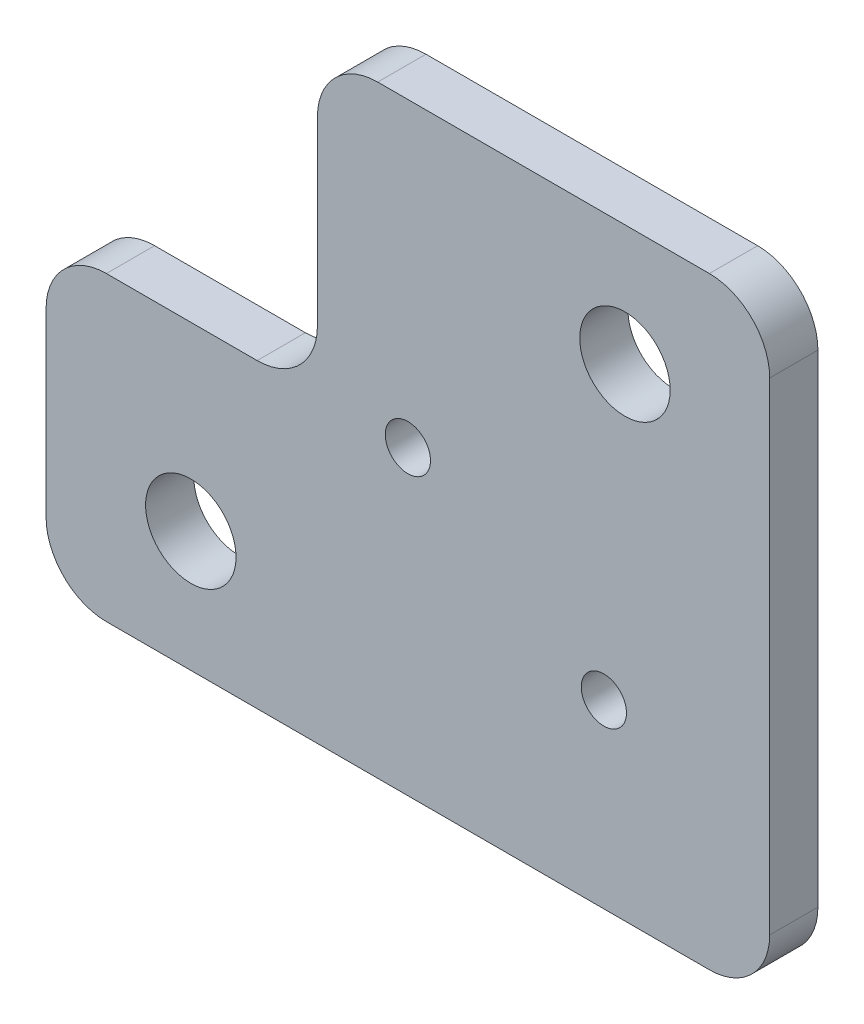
ISO-10303-21;
HEADER;
FILE_DESCRIPTION(('STEP AP214'),'2;1');
FILE_NAME('part.step','',(''),(''),'','','');
FILE_SCHEMA(('AUTOMOTIVE_DESIGN { 1 0 10303 214 1 1 1 1 }'));
ENDSEC;
DATA;
#1=APPLICATION_CONTEXT('core data for automotive mechanical design processes');
#2=APPLICATION_PROTOCOL_DEFINITION('international standard','automotive_design',2000,#1);
#3=PRODUCT_CONTEXT('',#1,'mechanical');
#4=PRODUCT('Part','Part','',(#3));
#5=PRODUCT_RELATED_PRODUCT_CATEGORY('part','',(#4));
#6=PRODUCT_DEFINITION_FORMATION('','',#4);
#7=PRODUCT_DEFINITION_CONTEXT('part definition',#1,'design');
#8=PRODUCT_DEFINITION('design','',#6,#7);
#9=PRODUCT_DEFINITION_SHAPE('','',#8);
#10=(LENGTH_UNIT() NAMED_UNIT(*) SI_UNIT(.MILLI.,.METRE.));
#11=(NAMED_UNIT(*) PLANE_ANGLE_UNIT() SI_UNIT($,.RADIAN.));
#12=(NAMED_UNIT(*) SI_UNIT($,.STERADIAN.) SOLID_ANGLE_UNIT());
#13=UNCERTAINTY_MEASURE_WITH_UNIT(LENGTH_MEASURE(1.E-05),#10,'distance_accuracy_value','');
#14=(GEOMETRIC_REPRESENTATION_CONTEXT(3) GLOBAL_UNCERTAINTY_ASSIGNED_CONTEXT((#13)) GLOBAL_UNIT_ASSIGNED_CONTEXT((#10,
#11,#12)) REPRESENTATION_CONTEXT('',''));
#15=CARTESIAN_POINT('',(0.,0.,0.));
#16=DIRECTION('',(0.,0.,1.));
#17=DIRECTION('',(1.,0.,0.));
#18=AXIS2_PLACEMENT_3D('',#15,#16,#17);
#19=CARTESIAN_POINT('',(6.,-5.,0.8));
#20=DIRECTION('',(-1.,0.,0.));
#21=DIRECTION('',(0.,0.,1.));
#22=AXIS2_PLACEMENT_3D('',#19,#20,#21);
#23=PLANE('',#22);
#24=DIRECTION('',(0.,1.,0.));
#25=VECTOR('',#24,1.);
#26=CARTESIAN_POINT('',(6.,-5.,0.8));
#27=LINE('',#26,#25);
#28=CARTESIAN_POINT('',(6.,-4.,0.8));
#29=VERTEX_POINT('',#28);
#30=CARTESIAN_POINT('',(6.,4.,0.8));
#31=VERTEX_POINT('',#30);
#32=EDGE_CURVE('E150',#29,#31,#27,.T.);
#33=ORIENTED_EDGE('',*,*,#32,.F.);
#34=DIRECTION('',(0.,0.,-1.));
#35=VECTOR('',#34,1.);
#36=CARTESIAN_POINT('',(6.,-4.,0.8));
#37=LINE('',#36,#35);
#38=CARTESIAN_POINT('',(6.,-4.,0.));
#39=VERTEX_POINT('',#38);
#40=EDGE_CURVE('E178',#29,#39,#37,.T.);
#41=ORIENTED_EDGE('',*,*,#40,.T.);
#42=DIRECTION('',(0.,1.,0.));
#43=VECTOR('',#42,1.);
#44=CARTESIAN_POINT('',(6.,-5.,0.));
#45=LINE('',#44,#43);
#46=CARTESIAN_POINT('',(6.,4.,0.));
#47=VERTEX_POINT('',#46);
#48=EDGE_CURVE('E247',#39,#47,#45,.T.);
#49=ORIENTED_EDGE('',*,*,#48,.T.);
#50=DIRECTION('',(0.,0.,-1.));
#51=VECTOR('',#50,1.);
#52=CARTESIAN_POINT('',(6.,4.,0.8));
#53=LINE('',#52,#51);
#54=EDGE_CURVE('E49',#47,#31,#53,.F.);
#55=ORIENTED_EDGE('',*,*,#54,.T.);
#56=EDGE_LOOP('',(#33,#41,#49,#55));
#57=FACE_BOUND('',#56,.T.);
#58=ADVANCED_FACE('F34',(#57),#23,.F.);
#59=CARTESIAN_POINT('',(-6.,5.,0.8));
#60=DIRECTION('',(0.,-1.,0.));
#61=DIRECTION('',(0.,0.,-1.));
#62=AXIS2_PLACEMENT_3D('',#59,#60,#61);
#63=PLANE('',#62);
#64=DIRECTION('',(-1.,0.,0.));
#65=VECTOR('',#64,1.);
#66=CARTESIAN_POINT('',(-6.,5.,0.8));
#67=LINE('',#66,#65);
#68=CARTESIAN_POINT('',(5.,5.,0.8));
#69=VERTEX_POINT('',#68);
#70=CARTESIAN_POINT('',(-0.499999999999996,5.,0.8));
#71=VERTEX_POINT('',#70);
#72=EDGE_CURVE('E153',#69,#71,#67,.T.);
#73=ORIENTED_EDGE('',*,*,#72,.F.);
#74=DIRECTION('',(0.,0.,-1.));
#75=VECTOR('',#74,1.);
#76=CARTESIAN_POINT('',(5.,5.,0.8));
#77=LINE('',#76,#75);
#78=CARTESIAN_POINT('',(5.,5.,0.));
#79=VERTEX_POINT('',#78);
#80=EDGE_CURVE('E184',#69,#79,#77,.T.);
#81=ORIENTED_EDGE('',*,*,#80,.T.);
#82=DIRECTION('',(-1.,0.,0.));
#83=VECTOR('',#82,1.);
#84=CARTESIAN_POINT('',(-6.,5.,0.));
#85=LINE('',#84,#83);
#86=CARTESIAN_POINT('',(-0.499999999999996,5.,0.));
#87=VERTEX_POINT('',#86);
#88=EDGE_CURVE('E155',#79,#87,#85,.T.);
#89=ORIENTED_EDGE('',*,*,#88,.T.);
#90=DIRECTION('',(0.,0.,1.));
#91=VECTOR('',#90,1.);
#92=CARTESIAN_POINT('',(-0.499999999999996,5.,0.8));
#93=LINE('',#92,#91);
#94=EDGE_CURVE('E181',#87,#71,#93,.T.);
#95=ORIENTED_EDGE('',*,*,#94,.T.);
#96=EDGE_LOOP('',(#73,#81,#89,#95));
#97=FACE_BOUND('',#96,.T.);
#98=ADVANCED_FACE('F260',(#97),#63,.F.);
#99=CARTESIAN_POINT('',(-6.,-5.,0.8));
#100=DIRECTION('',(1.,0.,0.));
#101=DIRECTION('',(0.,0.,-1.));
#102=AXIS2_PLACEMENT_3D('',#99,#100,#101);
#103=PLANE('',#102);
#104=DIRECTION('',(0.,-1.,0.));
#105=VECTOR('',#104,1.);
#106=CARTESIAN_POINT('',(-6.,-5.,0.));
#107=LINE('',#106,#105);
#108=CARTESIAN_POINT('',(-6.,-0.999999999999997,0.));
#109=VERTEX_POINT('',#108);
#110=CARTESIAN_POINT('',(-6.,-4.,0.));
#111=VERTEX_POINT('',#110);
#112=EDGE_CURVE('E151',#109,#111,#107,.T.);
#113=ORIENTED_EDGE('',*,*,#112,.T.);
#114=DIRECTION('',(0.,0.,-1.));
#115=VECTOR('',#114,1.);
#116=CARTESIAN_POINT('',(-6.,-4.,0.8));
#117=LINE('',#116,#115);
#118=CARTESIAN_POINT('',(-6.,-4.,0.8));
#119=VERTEX_POINT('',#118);
#120=EDGE_CURVE('E129',#111,#119,#117,.F.);
#121=ORIENTED_EDGE('',*,*,#120,.T.);
#122=DIRECTION('',(0.,-1.,0.));
#123=VECTOR('',#122,1.);
#124=CARTESIAN_POINT('',(-6.,-5.,0.8));
#125=LINE('',#124,#123);
#126=CARTESIAN_POINT('',(-6.,-0.999999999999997,0.8));
#127=VERTEX_POINT('',#126);
#128=EDGE_CURVE('E252',#127,#119,#125,.T.);
#129=ORIENTED_EDGE('',*,*,#128,.F.);
#130=DIRECTION('',(0.,0.,1.));
#131=VECTOR('',#130,1.);
#132=CARTESIAN_POINT('',(-6.,-0.999999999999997,0.8));
#133=LINE('',#132,#131);
#134=EDGE_CURVE('E134',#127,#109,#133,.F.);
#135=ORIENTED_EDGE('',*,*,#134,.T.);
#136=EDGE_LOOP('',(#113,#121,#129,#135));
#137=FACE_BOUND('',#136,.T.);
#138=ADVANCED_FACE('F273',(#137),#103,.F.);
#139=CARTESIAN_POINT('',(-6.,-5.,0.8));
#140=DIRECTION('',(0.,1.,0.));
#141=DIRECTION('',(0.,0.,1.));
#142=AXIS2_PLACEMENT_3D('',#139,#140,#141);
#143=PLANE('',#142);
#144=DIRECTION('',(1.,0.,0.));
#145=VECTOR('',#144,1.);
#146=CARTESIAN_POINT('',(-6.,-5.,0.8));
#147=LINE('',#146,#145);
#148=CARTESIAN_POINT('',(-5.,-5.,0.8));
#149=VERTEX_POINT('',#148);
#150=CARTESIAN_POINT('',(5.,-5.,0.8));
#151=VERTEX_POINT('',#150);
#152=EDGE_CURVE('E143',#149,#151,#147,.T.);
#153=ORIENTED_EDGE('',*,*,#152,.F.);
#154=DIRECTION('',(0.,0.,-1.));
#155=VECTOR('',#154,1.);
#156=CARTESIAN_POINT('',(-5.,-5.,0.8));
#157=LINE('',#156,#155);
#158=CARTESIAN_POINT('',(-5.,-5.,0.));
#159=VERTEX_POINT('',#158);
#160=EDGE_CURVE('E128',#149,#159,#157,.T.);
#161=ORIENTED_EDGE('',*,*,#160,.T.);
#162=DIRECTION('',(1.,0.,0.));
#163=VECTOR('',#162,1.);
#164=CARTESIAN_POINT('',(-6.,-5.,0.));
#165=LINE('',#164,#163);
#166=CARTESIAN_POINT('',(5.,-5.,0.));
#167=VERTEX_POINT('',#166);
#168=EDGE_CURVE('E141',#159,#167,#165,.T.);
#169=ORIENTED_EDGE('',*,*,#168,.T.);
#170=DIRECTION('',(0.,0.,-1.));
#171=VECTOR('',#170,1.);
#172=CARTESIAN_POINT('',(5.,-5.,0.8));
#173=LINE('',#172,#171);
#174=EDGE_CURVE('E145',#167,#151,#173,.F.);
#175=ORIENTED_EDGE('',*,*,#174,.T.);
#176=EDGE_LOOP('',(#153,#161,#169,#175));
#177=FACE_BOUND('',#176,.T.);
#178=ADVANCED_FACE('F140',(#177),#143,.F.);
#179=CARTESIAN_POINT('',(0.,0.,0.8));
#180=DIRECTION('',(0.,0.,-1.));
#181=DIRECTION('',(-1.,0.,0.));
#182=AXIS2_PLACEMENT_3D('',#179,#180,#181);
#183=PLANE('',#182);
#184=CARTESIAN_POINT('',(3.25,-2.,0.8));
#185=DIRECTION('',(0.,0.,1.));
#186=DIRECTION('',(1.,0.,0.));
#187=AXIS2_PLACEMENT_3D('',#184,#185,#186);
#188=CIRCLE('',#187,0.375);
#189=CARTESIAN_POINT('',(3.625,-2.,0.8));
#190=VERTEX_POINT('',#189);
#191=EDGE_CURVE('E243',#190,#190,#188,.T.);
#192=ORIENTED_EDGE('',*,*,#191,.F.);
#193=EDGE_LOOP('',(#192));
#194=FACE_BOUND('',#193,.T.);
#195=CARTESIAN_POINT('',(3.6,3.,0.8));
#196=DIRECTION('',(0.,0.,1.));
#197=DIRECTION('',(1.,0.,0.));
#198=AXIS2_PLACEMENT_3D('',#195,#196,#197);
#199=CIRCLE('',#198,0.750000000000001);
#200=CARTESIAN_POINT('',(4.35,3.,0.8));
#201=VERTEX_POINT('',#200);
#202=EDGE_CURVE('E237',#201,#201,#199,.T.);
#203=ORIENTED_EDGE('',*,*,#202,.F.);
#204=EDGE_LOOP('',(#203));
#205=FACE_BOUND('',#204,.T.);
#206=CARTESIAN_POINT('',(-3.6,-3.,0.8));
#207=DIRECTION('',(0.,0.,1.));
#208=DIRECTION('',(1.,0.,0.));
#209=AXIS2_PLACEMENT_3D('',#206,#207,#208);
#210=CIRCLE('',#209,0.75);
#211=CARTESIAN_POINT('',(-2.84999999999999,-3.,0.8));
#212=VERTEX_POINT('',#211);
#213=EDGE_CURVE('E230',#212,#212,#210,.T.);
#214=ORIENTED_EDGE('',*,*,#213,.F.);
#215=EDGE_LOOP('',(#214));
#216=FACE_BOUND('',#215,.T.);
#217=CARTESIAN_POINT('',(0.,0.,0.8));
#218=DIRECTION('',(0.,0.,1.));
#219=DIRECTION('',(1.,0.,0.));
#220=AXIS2_PLACEMENT_3D('',#217,#218,#219);
#221=CIRCLE('',#220,0.375);
#222=CARTESIAN_POINT('',(0.375,0.,0.8));
#223=VERTEX_POINT('',#222);
#224=EDGE_CURVE('E244',#223,#223,#221,.T.);
#225=ORIENTED_EDGE('',*,*,#224,.F.);
#226=EDGE_LOOP('',(#225));
#227=FACE_BOUND('',#226,.T.);
#228=ORIENTED_EDGE('',*,*,#128,.T.);
#229=CARTESIAN_POINT('',(-5.,-4.,0.8));
#230=DIRECTION('',(0.,0.,-1.));
#231=DIRECTION('',(-1.,0.,0.));
#232=AXIS2_PLACEMENT_3D('',#229,#230,#231);
#233=CIRCLE('',#232,1.);
#234=EDGE_CURVE('E175',#119,#149,#233,.F.);
#235=ORIENTED_EDGE('',*,*,#234,.T.);
#236=ORIENTED_EDGE('',*,*,#152,.T.);
#237=CARTESIAN_POINT('',(5.,-4.,0.8));
#238=DIRECTION('',(0.,0.,-1.));
#239=DIRECTION('',(-1.,0.,0.));
#240=AXIS2_PLACEMENT_3D('',#237,#238,#239);
#241=CIRCLE('',#240,1.);
#242=EDGE_CURVE('E56',#151,#29,#241,.F.);
#243=ORIENTED_EDGE('',*,*,#242,.T.);
#244=ORIENTED_EDGE('',*,*,#32,.T.);
#245=CARTESIAN_POINT('',(5.,4.,0.8));
#246=DIRECTION('',(0.,0.,-1.));
#247=DIRECTION('',(-1.,0.,0.));
#248=AXIS2_PLACEMENT_3D('',#245,#246,#247);
#249=CIRCLE('',#248,1.);
#250=EDGE_CURVE('E172',#31,#69,#249,.F.);
#251=ORIENTED_EDGE('',*,*,#250,.T.);
#252=ORIENTED_EDGE('',*,*,#72,.T.);
#253=CARTESIAN_POINT('',(-0.499999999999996,4.,0.8));
#254=DIRECTION('',(0.,0.,-1.));
#255=DIRECTION('',(-1.,0.,0.));
#256=AXIS2_PLACEMENT_3D('',#253,#254,#255);
#257=CIRCLE('',#256,1.);
#258=CARTESIAN_POINT('',(-1.5,4.,0.8));
#259=VERTEX_POINT('',#258);
#260=EDGE_CURVE('E170',#71,#259,#257,.F.);
#261=ORIENTED_EDGE('',*,*,#260,.T.);
#262=DIRECTION('',(0.,1.,0.));
#263=VECTOR('',#262,1.);
#264=CARTESIAN_POINT('',(-1.5,5.,0.8));
#265=LINE('',#264,#263);
#266=CARTESIAN_POINT('',(-1.5,1.,0.8));
#267=VERTEX_POINT('',#266);
#268=EDGE_CURVE('E203',#267,#259,#265,.T.);
#269=ORIENTED_EDGE('',*,*,#268,.F.);
#270=CARTESIAN_POINT('',(-2.5,1.,0.8));
#271=DIRECTION('',(0.,0.,-1.));
#272=DIRECTION('',(-1.,0.,0.));
#273=AXIS2_PLACEMENT_3D('',#270,#271,#272);
#274=CIRCLE('',#273,1.);
#275=CARTESIAN_POINT('',(-2.5,0.,0.8));
#276=VERTEX_POINT('',#275);
#277=EDGE_CURVE('E42',#267,#276,#274,.T.);
#278=ORIENTED_EDGE('',*,*,#277,.T.);
#279=DIRECTION('',(1.,0.,0.));
#280=VECTOR('',#279,1.);
#281=CARTESIAN_POINT('',(-6.,0.,0.8));
#282=LINE('',#281,#280);
#283=CARTESIAN_POINT('',(-5.,0.,0.8));
#284=VERTEX_POINT('',#283);
#285=EDGE_CURVE('E201',#284,#276,#282,.T.);
#286=ORIENTED_EDGE('',*,*,#285,.F.);
#287=CARTESIAN_POINT('',(-5.,-0.999999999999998,0.8));
#288=DIRECTION('',(0.,0.,-1.));
#289=DIRECTION('',(-1.,0.,0.));
#290=AXIS2_PLACEMENT_3D('',#287,#288,#289);
#291=CIRCLE('',#290,1.);
#292=EDGE_CURVE('E168',#284,#127,#291,.F.);
#293=ORIENTED_EDGE('',*,*,#292,.T.);
#294=EDGE_LOOP('',(#228,#235,#236,#243,#244,#251,#252,#261,#269,#278,#286,#293));
#295=FACE_BOUND('',#294,.T.);
#296=ADVANCED_FACE('F200',(#194,#205,#216,#227,#295),#183,.F.);
#297=CARTESIAN_POINT('',(0.,0.,0.));
#298=DIRECTION('',(0.,0.,-1.));
#299=DIRECTION('',(-1.,0.,0.));
#300=AXIS2_PLACEMENT_3D('',#297,#298,#299);
#301=PLANE('',#300);
#302=ORIENTED_EDGE('',*,*,#168,.F.);
#303=CARTESIAN_POINT('',(-5.,-4.,0.));
#304=DIRECTION('',(0.,0.,-1.));
#305=DIRECTION('',(-1.,0.,0.));
#306=AXIS2_PLACEMENT_3D('',#303,#304,#305);
#307=CIRCLE('',#306,1.);
#308=EDGE_CURVE('E124',#159,#111,#307,.T.);
#309=ORIENTED_EDGE('',*,*,#308,.T.);
#310=ORIENTED_EDGE('',*,*,#112,.F.);
#311=CARTESIAN_POINT('',(-5.,-0.999999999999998,0.));
#312=DIRECTION('',(0.,0.,-1.));
#313=DIRECTION('',(-1.,0.,0.));
#314=AXIS2_PLACEMENT_3D('',#311,#312,#313);
#315=CIRCLE('',#314,1.);
#316=CARTESIAN_POINT('',(-5.,0.,0.));
#317=VERTEX_POINT('',#316);
#318=EDGE_CURVE('E144',#109,#317,#315,.T.);
#319=ORIENTED_EDGE('',*,*,#318,.T.);
#320=DIRECTION('',(1.,0.,0.));
#321=VECTOR('',#320,1.);
#322=CARTESIAN_POINT('',(-6.,0.,0.));
#323=LINE('',#322,#321);
#324=CARTESIAN_POINT('',(-2.5,0.,0.));
#325=VERTEX_POINT('',#324);
#326=EDGE_CURVE('E219',#317,#325,#323,.T.);
#327=ORIENTED_EDGE('',*,*,#326,.T.);
#328=CARTESIAN_POINT('',(-2.5,1.,0.));
#329=DIRECTION('',(0.,0.,-1.));
#330=DIRECTION('',(-1.,0.,0.));
#331=AXIS2_PLACEMENT_3D('',#328,#329,#330);
#332=CIRCLE('',#331,1.);
#333=CARTESIAN_POINT('',(-1.5,1.,0.));
#334=VERTEX_POINT('',#333);
#335=EDGE_CURVE('E11',#325,#334,#332,.F.);
#336=ORIENTED_EDGE('',*,*,#335,.T.);
#337=DIRECTION('',(0.,1.,0.));
#338=VECTOR('',#337,1.);
#339=CARTESIAN_POINT('',(-1.5,5.,0.));
#340=LINE('',#339,#338);
#341=CARTESIAN_POINT('',(-1.5,4.,0.));
#342=VERTEX_POINT('',#341);
#343=EDGE_CURVE('E212',#334,#342,#340,.T.);
#344=ORIENTED_EDGE('',*,*,#343,.T.);
#345=CARTESIAN_POINT('',(-0.499999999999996,4.,0.));
#346=DIRECTION('',(0.,0.,-1.));
#347=DIRECTION('',(-1.,0.,0.));
#348=AXIS2_PLACEMENT_3D('',#345,#346,#347);
#349=CIRCLE('',#348,1.);
#350=EDGE_CURVE('E161',#342,#87,#349,.T.);
#351=ORIENTED_EDGE('',*,*,#350,.T.);
#352=ORIENTED_EDGE('',*,*,#88,.F.);
#353=CARTESIAN_POINT('',(5.,4.,0.));
#354=DIRECTION('',(0.,0.,-1.));
#355=DIRECTION('',(-1.,0.,0.));
#356=AXIS2_PLACEMENT_3D('',#353,#354,#355);
#357=CIRCLE('',#356,1.);
#358=EDGE_CURVE('E163',#79,#47,#357,.T.);
#359=ORIENTED_EDGE('',*,*,#358,.T.);
#360=ORIENTED_EDGE('',*,*,#48,.F.);
#361=CARTESIAN_POINT('',(5.,-4.,0.));
#362=DIRECTION('',(0.,0.,-1.));
#363=DIRECTION('',(-1.,0.,0.));
#364=AXIS2_PLACEMENT_3D('',#361,#362,#363);
#365=CIRCLE('',#364,1.);
#366=EDGE_CURVE('E135',#39,#167,#365,.T.);
#367=ORIENTED_EDGE('',*,*,#366,.T.);
#368=EDGE_LOOP('',(#302,#309,#310,#319,#327,#336,#344,#351,#352,#359,#360,#367));
#369=FACE_BOUND('',#368,.T.);
#370=CARTESIAN_POINT('',(3.25,-2.,0.));
#371=DIRECTION('',(0.,0.,-1.));
#372=DIRECTION('',(-1.,0.,0.));
#373=AXIS2_PLACEMENT_3D('',#370,#371,#372);
#374=CIRCLE('',#373,0.375);
#375=CARTESIAN_POINT('',(2.875,-2.,0.));
#376=VERTEX_POINT('',#375);
#377=EDGE_CURVE('E225',#376,#376,#374,.F.);
#378=ORIENTED_EDGE('',*,*,#377,.T.);
#379=EDGE_LOOP('',(#378));
#380=FACE_BOUND('',#379,.T.);
#381=CARTESIAN_POINT('',(3.6,3.,0.));
#382=DIRECTION('',(0.,0.,-1.));
#383=DIRECTION('',(-1.,0.,0.));
#384=AXIS2_PLACEMENT_3D('',#381,#382,#383);
#385=CIRCLE('',#384,0.750000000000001);
#386=CARTESIAN_POINT('',(4.35,3.,0.));
#387=VERTEX_POINT('',#386);
#388=EDGE_CURVE('E240',#387,#387,#385,.F.);
#389=ORIENTED_EDGE('',*,*,#388,.T.);
#390=EDGE_LOOP('',(#389));
#391=FACE_BOUND('',#390,.T.);
#392=CARTESIAN_POINT('',(-3.6,-3.,0.));
#393=DIRECTION('',(0.,0.,-1.));
#394=DIRECTION('',(-1.,0.,0.));
#395=AXIS2_PLACEMENT_3D('',#392,#393,#394);
#396=CIRCLE('',#395,0.75);
#397=CARTESIAN_POINT('',(-2.84999999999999,-3.,0.));
#398=VERTEX_POINT('',#397);
#399=EDGE_CURVE('E234',#398,#398,#396,.F.);
#400=ORIENTED_EDGE('',*,*,#399,.T.);
#401=EDGE_LOOP('',(#400));
#402=FACE_BOUND('',#401,.T.);
#403=CARTESIAN_POINT('',(0.,0.,0.));
#404=DIRECTION('',(0.,0.,-1.));
#405=DIRECTION('',(-1.,0.,0.));
#406=AXIS2_PLACEMENT_3D('',#403,#404,#405);
#407=CIRCLE('',#406,0.375);
#408=CARTESIAN_POINT('',(-0.375,0.,0.));
#409=VERTEX_POINT('',#408);
#410=EDGE_CURVE('E233',#409,#409,#407,.F.);
#411=ORIENTED_EDGE('',*,*,#410,.T.);
#412=EDGE_LOOP('',(#411));
#413=FACE_BOUND('',#412,.T.);
#414=ADVANCED_FACE('F147',(#369,#380,#391,#402,#413),#301,.T.);
#415=CARTESIAN_POINT('',(0.,0.,-0.00100000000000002));
#416=DIRECTION('',(0.,0.,1.));
#417=DIRECTION('',(1.,0.,0.));
#418=AXIS2_PLACEMENT_3D('',#415,#416,#417);
#419=CYLINDRICAL_SURFACE('',#418,0.375);
#420=ORIENTED_EDGE('',*,*,#410,.F.);
#421=EDGE_LOOP('',(#420));
#422=FACE_BOUND('',#421,.T.);
#423=ORIENTED_EDGE('',*,*,#224,.T.);
#424=EDGE_LOOP('',(#423));
#425=FACE_BOUND('',#424,.T.);
#426=ADVANCED_FACE('F367',(#422,#425),#419,.F.);
#427=CARTESIAN_POINT('',(-3.6,-3.,-0.00100000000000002));
#428=DIRECTION('',(0.,0.,1.));
#429=DIRECTION('',(1.,0.,0.));
#430=AXIS2_PLACEMENT_3D('',#427,#428,#429);
#431=CYLINDRICAL_SURFACE('',#430,0.75);
#432=CARTESIAN_POINT('',(-2.84999999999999,-3.,0.));
#433=CARTESIAN_POINT('',(-2.84999999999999,-3.,0.00833333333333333));
#434=CARTESIAN_POINT('',(-2.84999999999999,-3.,0.0166666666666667));
#435=CARTESIAN_POINT('',(-2.84999999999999,-3.,0.0333333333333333));
#436=CARTESIAN_POINT('',(-2.84999999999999,-3.,0.0416666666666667));
#437=CARTESIAN_POINT('',(-2.84999999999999,-3.,0.0583333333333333));
#438=CARTESIAN_POINT('',(-2.84999999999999,-3.,0.0666666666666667));
#439=CARTESIAN_POINT('',(-2.84999999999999,-3.,0.0833333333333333));
#440=CARTESIAN_POINT('',(-2.84999999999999,-3.,0.0916666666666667));
#441=CARTESIAN_POINT('',(-2.84999999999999,-3.,0.108333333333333));
#442=CARTESIAN_POINT('',(-2.84999999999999,-3.,0.116666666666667));
#443=CARTESIAN_POINT('',(-2.84999999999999,-3.,0.133333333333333));
#444=CARTESIAN_POINT('',(-2.84999999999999,-3.,0.141666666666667));
#445=CARTESIAN_POINT('',(-2.84999999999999,-3.,0.158333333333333));
#446=CARTESIAN_POINT('',(-2.84999999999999,-3.,0.166666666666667));
#447=CARTESIAN_POINT('',(-2.84999999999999,-3.,0.183333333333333));
#448=CARTESIAN_POINT('',(-2.84999999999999,-3.,0.191666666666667));
#449=CARTESIAN_POINT('',(-2.84999999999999,-3.,0.208333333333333));
#450=CARTESIAN_POINT('',(-2.84999999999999,-3.,0.216666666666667));
#451=CARTESIAN_POINT('',(-2.84999999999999,-3.,0.233333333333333));
#452=CARTESIAN_POINT('',(-2.84999999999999,-3.,0.241666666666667));
#453=CARTESIAN_POINT('',(-2.84999999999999,-3.,0.258333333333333));
#454=CARTESIAN_POINT('',(-2.84999999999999,-3.,0.266666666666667));
#455=CARTESIAN_POINT('',(-2.84999999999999,-3.,0.283333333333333));
#456=CARTESIAN_POINT('',(-2.84999999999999,-3.,0.291666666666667));
#457=CARTESIAN_POINT('',(-2.84999999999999,-3.,0.308333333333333));
#458=CARTESIAN_POINT('',(-2.84999999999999,-3.,0.316666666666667));
#459=CARTESIAN_POINT('',(-2.84999999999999,-3.,0.333333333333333));
#460=CARTESIAN_POINT('',(-2.84999999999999,-3.,0.341666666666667));
#461=CARTESIAN_POINT('',(-2.84999999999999,-3.,0.358333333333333));
#462=CARTESIAN_POINT('',(-2.84999999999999,-3.,0.366666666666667));
#463=CARTESIAN_POINT('',(-2.84999999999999,-3.,0.383333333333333));
#464=CARTESIAN_POINT('',(-2.84999999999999,-3.,0.391666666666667));
#465=CARTESIAN_POINT('',(-2.84999999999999,-3.,0.408333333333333));
#466=CARTESIAN_POINT('',(-2.84999999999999,-3.,0.416666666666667));
#467=CARTESIAN_POINT('',(-2.84999999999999,-3.,0.433333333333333));
#468=CARTESIAN_POINT('',(-2.84999999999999,-3.,0.441666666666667));
#469=CARTESIAN_POINT('',(-2.84999999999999,-3.,0.458333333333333));
#470=CARTESIAN_POINT('',(-2.84999999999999,-3.,0.466666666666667));
#471=CARTESIAN_POINT('',(-2.84999999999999,-3.,0.483333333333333));
#472=CARTESIAN_POINT('',(-2.84999999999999,-3.,0.491666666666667));
#473=CARTESIAN_POINT('',(-2.84999999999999,-3.,0.508333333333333));
#474=CARTESIAN_POINT('',(-2.84999999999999,-3.,0.516666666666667));
#475=CARTESIAN_POINT('',(-2.84999999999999,-3.,0.533333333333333));
#476=CARTESIAN_POINT('',(-2.84999999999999,-3.,0.541666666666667));
#477=CARTESIAN_POINT('',(-2.84999999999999,-3.,0.558333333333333));
#478=CARTESIAN_POINT('',(-2.84999999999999,-3.,0.566666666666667));
#479=CARTESIAN_POINT('',(-2.84999999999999,-3.,0.583333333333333));
#480=CARTESIAN_POINT('',(-2.84999999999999,-3.,0.591666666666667));
#481=CARTESIAN_POINT('',(-2.84999999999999,-3.,0.608333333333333));
#482=CARTESIAN_POINT('',(-2.84999999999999,-3.,0.616666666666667));
#483=CARTESIAN_POINT('',(-2.84999999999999,-3.,0.633333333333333));
#484=CARTESIAN_POINT('',(-2.84999999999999,-3.,0.641666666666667));
#485=CARTESIAN_POINT('',(-2.84999999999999,-3.,0.658333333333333));
#486=CARTESIAN_POINT('',(-2.84999999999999,-3.,0.666666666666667));
#487=CARTESIAN_POINT('',(-2.84999999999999,-3.,0.683333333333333));
#488=CARTESIAN_POINT('',(-2.84999999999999,-3.,0.691666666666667));
#489=CARTESIAN_POINT('',(-2.84999999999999,-3.,0.708333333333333));
#490=CARTESIAN_POINT('',(-2.84999999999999,-3.,0.716666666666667));
#491=CARTESIAN_POINT('',(-2.84999999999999,-3.,0.733333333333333));
#492=CARTESIAN_POINT('',(-2.84999999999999,-3.,0.741666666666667));
#493=CARTESIAN_POINT('',(-2.84999999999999,-3.,0.758333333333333));
#494=CARTESIAN_POINT('',(-2.84999999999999,-3.,0.766666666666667));
#495=CARTESIAN_POINT('',(-2.84999999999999,-3.,0.783333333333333));
#496=CARTESIAN_POINT('',(-2.84999999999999,-3.,0.791666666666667));
#497=CARTESIAN_POINT('',(-2.84999999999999,-3.,0.8));
#498=B_SPLINE_CURVE_WITH_KNOTS('',3,(#432,#433,#434,#435,#436,#437,#438,#439,#440,#441,#442,
#443,#444,#445,#446,#447,#448,#449,#450,#451,#452,#453,#454,#455,#456,#457,#458,#459,#460,#461,
#462,#463,#464,#465,#466,#467,#468,#469,#470,#471,#472,#473,#474,#475,#476,#477,#478,#479,#480,
#481,#482,#483,#484,#485,#486,#487,#488,#489,#490,#491,#492,#493,#494,#495,#496,#497),
.UNSPECIFIED.,.F.,.F.,(4,2,2,2,2,2,2,2,2,2,2,2,2,2,2,2,2,2,2,2,2,2,2,2,2,2,2,2,2,2,2,2,4),(0.,
0.025,0.05,0.075,0.1,0.125,0.15,0.175,0.2,0.225,0.25,0.275,0.3,0.325,0.35,0.375,0.4,0.425,0.45,
0.475,0.5,0.525,0.55,0.575,0.6,0.625,0.65,0.675,0.7,0.725,0.75,0.775,0.8),.UNSPECIFIED.);
#499=EDGE_CURVE('BSEAM358',#398,#212,#498,.T.);
#500=ORIENTED_EDGE('',*,*,#399,.F.);
#501=ORIENTED_EDGE('',*,*,#213,.T.);
#502=ORIENTED_EDGE('',*,*,#499,.T.);
#503=ORIENTED_EDGE('',*,*,#499,.F.);
#504=EDGE_LOOP('',(#500,#502,#501,#503));
#505=FACE_BOUND('',#504,.T.);
#506=ADVANCED_FACE('F358',(#505),#431,.F.);
#507=CARTESIAN_POINT('',(3.6,3.,-0.00100000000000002));
#508=DIRECTION('',(0.,0.,1.));
#509=DIRECTION('',(1.,0.,0.));
#510=AXIS2_PLACEMENT_3D('',#507,#508,#509);
#511=CYLINDRICAL_SURFACE('',#510,0.750000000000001);
#512=CARTESIAN_POINT('',(4.35,3.,0.));
#513=CARTESIAN_POINT('',(4.35,3.,0.00833333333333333));
#514=CARTESIAN_POINT('',(4.35,3.,0.0166666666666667));
#515=CARTESIAN_POINT('',(4.35,3.,0.0333333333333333));
#516=CARTESIAN_POINT('',(4.35,3.,0.0416666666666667));
#517=CARTESIAN_POINT('',(4.35,3.,0.0583333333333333));
#518=CARTESIAN_POINT('',(4.35,3.,0.0666666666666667));
#519=CARTESIAN_POINT('',(4.35,3.,0.0833333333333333));
#520=CARTESIAN_POINT('',(4.35,3.,0.0916666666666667));
#521=CARTESIAN_POINT('',(4.35,3.,0.108333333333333));
#522=CARTESIAN_POINT('',(4.35,3.,0.116666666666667));
#523=CARTESIAN_POINT('',(4.35,3.,0.133333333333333));
#524=CARTESIAN_POINT('',(4.35,3.,0.141666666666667));
#525=CARTESIAN_POINT('',(4.35,3.,0.158333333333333));
#526=CARTESIAN_POINT('',(4.35,3.,0.166666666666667));
#527=CARTESIAN_POINT('',(4.35,3.,0.183333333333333));
#528=CARTESIAN_POINT('',(4.35,3.,0.191666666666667));
#529=CARTESIAN_POINT('',(4.35,3.,0.208333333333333));
#530=CARTESIAN_POINT('',(4.35,3.,0.216666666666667));
#531=CARTESIAN_POINT('',(4.35,3.,0.233333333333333));
#532=CARTESIAN_POINT('',(4.35,3.,0.241666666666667));
#533=CARTESIAN_POINT('',(4.35,3.,0.258333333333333));
#534=CARTESIAN_POINT('',(4.35,3.,0.266666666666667));
#535=CARTESIAN_POINT('',(4.35,3.,0.283333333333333));
#536=CARTESIAN_POINT('',(4.35,3.,0.291666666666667));
#537=CARTESIAN_POINT('',(4.35,3.,0.308333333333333));
#538=CARTESIAN_POINT('',(4.35,3.,0.316666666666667));
#539=CARTESIAN_POINT('',(4.35,3.,0.333333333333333));
#540=CARTESIAN_POINT('',(4.35,3.,0.341666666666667));
#541=CARTESIAN_POINT('',(4.35,3.,0.358333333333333));
#542=CARTESIAN_POINT('',(4.35,3.,0.366666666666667));
#543=CARTESIAN_POINT('',(4.35,3.,0.383333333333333));
#544=CARTESIAN_POINT('',(4.35,3.,0.391666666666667));
#545=CARTESIAN_POINT('',(4.35,3.,0.408333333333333));
#546=CARTESIAN_POINT('',(4.35,3.,0.416666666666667));
#547=CARTESIAN_POINT('',(4.35,3.,0.433333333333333));
#548=CARTESIAN_POINT('',(4.35,3.,0.441666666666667));
#549=CARTESIAN_POINT('',(4.35,3.,0.458333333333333));
#550=CARTESIAN_POINT('',(4.35,3.,0.466666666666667));
#551=CARTESIAN_POINT('',(4.35,3.,0.483333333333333));
#552=CARTESIAN_POINT('',(4.35,3.,0.491666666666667));
#553=CARTESIAN_POINT('',(4.35,3.,0.508333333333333));
#554=CARTESIAN_POINT('',(4.35,3.,0.516666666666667));
#555=CARTESIAN_POINT('',(4.35,3.,0.533333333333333));
#556=CARTESIAN_POINT('',(4.35,3.,0.541666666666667));
#557=CARTESIAN_POINT('',(4.35,3.,0.558333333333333));
#558=CARTESIAN_POINT('',(4.35,3.,0.566666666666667));
#559=CARTESIAN_POINT('',(4.35,3.,0.583333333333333));
#560=CARTESIAN_POINT('',(4.35,3.,0.591666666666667));
#561=CARTESIAN_POINT('',(4.35,3.,0.608333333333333));
#562=CARTESIAN_POINT('',(4.35,3.,0.616666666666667));
#563=CARTESIAN_POINT('',(4.35,3.,0.633333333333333));
#564=CARTESIAN_POINT('',(4.35,3.,0.641666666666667));
#565=CARTESIAN_POINT('',(4.35,3.,0.658333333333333));
#566=CARTESIAN_POINT('',(4.35,3.,0.666666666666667));
#567=CARTESIAN_POINT('',(4.35,3.,0.683333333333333));
#568=CARTESIAN_POINT('',(4.35,3.,0.691666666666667));
#569=CARTESIAN_POINT('',(4.35,3.,0.708333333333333));
#570=CARTESIAN_POINT('',(4.35,3.,0.716666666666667));
#571=CARTESIAN_POINT('',(4.35,3.,0.733333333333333));
#572=CARTESIAN_POINT('',(4.35,3.,0.741666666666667));
#573=CARTESIAN_POINT('',(4.35,3.,0.758333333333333));
#574=CARTESIAN_POINT('',(4.35,3.,0.766666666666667));
#575=CARTESIAN_POINT('',(4.35,3.,0.783333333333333));
#576=CARTESIAN_POINT('',(4.35,3.,0.791666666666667));
#577=CARTESIAN_POINT('',(4.35,3.,0.8));
#578=B_SPLINE_CURVE_WITH_KNOTS('',3,(#512,#513,#514,#515,#516,#517,#518,#519,#520,#521,#522,
#523,#524,#525,#526,#527,#528,#529,#530,#531,#532,#533,#534,#535,#536,#537,#538,#539,#540,#541,
#542,#543,#544,#545,#546,#547,#548,#549,#550,#551,#552,#553,#554,#555,#556,#557,#558,#559,#560,
#561,#562,#563,#564,#565,#566,#567,#568,#569,#570,#571,#572,#573,#574,#575,#576,#577),
.UNSPECIFIED.,.F.,.F.,(4,2,2,2,2,2,2,2,2,2,2,2,2,2,2,2,2,2,2,2,2,2,2,2,2,2,2,2,2,2,2,2,4),(0.,
0.025,0.05,0.075,0.1,0.125,0.15,0.175,0.2,0.225,0.25,0.275,0.3,0.325,0.35,0.375,0.4,0.425,0.45,
0.475,0.5,0.525,0.55,0.575,0.6,0.625,0.65,0.675,0.7,0.725,0.75,0.775,0.8),.UNSPECIFIED.);
#579=EDGE_CURVE('BSEAM349',#387,#201,#578,.T.);
#580=ORIENTED_EDGE('',*,*,#388,.F.);
#581=ORIENTED_EDGE('',*,*,#202,.T.);
#582=ORIENTED_EDGE('',*,*,#579,.T.);
#583=ORIENTED_EDGE('',*,*,#579,.F.);
#584=EDGE_LOOP('',(#580,#582,#581,#583));
#585=FACE_BOUND('',#584,.T.);
#586=ADVANCED_FACE('F349',(#585),#511,.F.);
#587=CARTESIAN_POINT('',(3.25,-2.,-0.00100000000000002));
#588=DIRECTION('',(0.,0.,1.));
#589=DIRECTION('',(1.,0.,0.));
#590=AXIS2_PLACEMENT_3D('',#587,#588,#589);
#591=CYLINDRICAL_SURFACE('',#590,0.375);
#592=ORIENTED_EDGE('',*,*,#377,.F.);
#593=EDGE_LOOP('',(#592));
#594=FACE_BOUND('',#593,.T.);
#595=ORIENTED_EDGE('',*,*,#191,.T.);
#596=EDGE_LOOP('',(#595));
#597=FACE_BOUND('',#596,.T.);
#598=ADVANCED_FACE('F340',(#594,#597),#591,.F.);
#599=CARTESIAN_POINT('',(-1.5,5.,-0.00100000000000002));
#600=DIRECTION('',(1.,0.,0.));
#601=DIRECTION('',(0.,1.,0.));
#602=AXIS2_PLACEMENT_3D('',#599,#600,#601);
#603=PLANE('',#602);
#604=ORIENTED_EDGE('',*,*,#268,.T.);
#605=DIRECTION('',(0.,0.,1.));
#606=VECTOR('',#605,1.);
#607=CARTESIAN_POINT('',(-1.5,4.,-0.00100000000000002));
#608=LINE('',#607,#606);
#609=EDGE_CURVE('E190',#259,#342,#608,.F.);
#610=ORIENTED_EDGE('',*,*,#609,.T.);
#611=ORIENTED_EDGE('',*,*,#343,.F.);
#612=DIRECTION('',(0.,0.,1.));
#613=VECTOR('',#612,1.);
#614=CARTESIAN_POINT('',(-1.5,1.,0.8));
#615=LINE('',#614,#613);
#616=EDGE_CURVE('E187',#334,#267,#615,.T.);
#617=ORIENTED_EDGE('',*,*,#616,.T.);
#618=EDGE_LOOP('',(#604,#610,#611,#617));
#619=FACE_BOUND('',#618,.T.);
#620=ADVANCED_FACE('F221',(#619),#603,.F.);
#621=CARTESIAN_POINT('',(-6.,0.,-0.00100000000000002));
#622=DIRECTION('',(0.,-1.,0.));
#623=DIRECTION('',(1.,0.,0.));
#624=AXIS2_PLACEMENT_3D('',#621,#622,#623);
#625=PLANE('',#624);
#626=ORIENTED_EDGE('',*,*,#285,.T.);
#627=DIRECTION('',(0.,0.,1.));
#628=VECTOR('',#627,1.);
#629=CARTESIAN_POINT('',(-2.5,0.,0.));
#630=LINE('',#629,#628);
#631=EDGE_CURVE('E195',#276,#325,#630,.F.);
#632=ORIENTED_EDGE('',*,*,#631,.T.);
#633=ORIENTED_EDGE('',*,*,#326,.F.);
#634=DIRECTION('',(0.,0.,1.));
#635=VECTOR('',#634,1.);
#636=CARTESIAN_POINT('',(-5.,0.,-0.00100000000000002));
#637=LINE('',#636,#635);
#638=EDGE_CURVE('E192',#317,#284,#637,.T.);
#639=ORIENTED_EDGE('',*,*,#638,.T.);
#640=EDGE_LOOP('',(#626,#632,#633,#639));
#641=FACE_BOUND('',#640,.T.);
#642=ADVANCED_FACE('F208',(#641),#625,.F.);
#643=CARTESIAN_POINT('',(-5.,-4.,0.8));
#644=DIRECTION('',(0.,0.,-1.));
#645=DIRECTION('',(-1.,0.,0.));
#646=AXIS2_PLACEMENT_3D('',#643,#644,#645);
#647=CYLINDRICAL_SURFACE('',#646,1.);
#648=ORIENTED_EDGE('',*,*,#234,.F.);
#649=ORIENTED_EDGE('',*,*,#120,.F.);
#650=ORIENTED_EDGE('',*,*,#308,.F.);
#651=ORIENTED_EDGE('',*,*,#160,.F.);
#652=EDGE_LOOP('',(#648,#649,#650,#651));
#653=FACE_BOUND('',#652,.T.);
#654=ADVANCED_FACE('F127',(#653),#647,.T.);
#655=CARTESIAN_POINT('',(5.,-4.,0.8));
#656=DIRECTION('',(0.,0.,-1.));
#657=DIRECTION('',(-1.,0.,0.));
#658=AXIS2_PLACEMENT_3D('',#655,#656,#657);
#659=CYLINDRICAL_SURFACE('',#658,1.);
#660=ORIENTED_EDGE('',*,*,#242,.F.);
#661=ORIENTED_EDGE('',*,*,#174,.F.);
#662=ORIENTED_EDGE('',*,*,#366,.F.);
#663=ORIENTED_EDGE('',*,*,#40,.F.);
#664=EDGE_LOOP('',(#660,#661,#662,#663));
#665=FACE_BOUND('',#664,.T.);
#666=ADVANCED_FACE('F269',(#665),#659,.T.);
#667=CARTESIAN_POINT('',(5.,4.,0.8));
#668=DIRECTION('',(0.,0.,-1.));
#669=DIRECTION('',(-1.,0.,0.));
#670=AXIS2_PLACEMENT_3D('',#667,#668,#669);
#671=CYLINDRICAL_SURFACE('',#670,1.);
#672=ORIENTED_EDGE('',*,*,#250,.F.);
#673=ORIENTED_EDGE('',*,*,#54,.F.);
#674=ORIENTED_EDGE('',*,*,#358,.F.);
#675=ORIENTED_EDGE('',*,*,#80,.F.);
#676=EDGE_LOOP('',(#672,#673,#674,#675));
#677=FACE_BOUND('',#676,.T.);
#678=ADVANCED_FACE('F266',(#677),#671,.T.);
#679=CARTESIAN_POINT('',(-0.499999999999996,4.,0.8));
#680=DIRECTION('',(0.,0.,1.));
#681=DIRECTION('',(1.,0.,0.));
#682=AXIS2_PLACEMENT_3D('',#679,#680,#681);
#683=CYLINDRICAL_SURFACE('',#682,1.);
#684=ORIENTED_EDGE('',*,*,#350,.F.);
#685=ORIENTED_EDGE('',*,*,#609,.F.);
#686=ORIENTED_EDGE('',*,*,#260,.F.);
#687=ORIENTED_EDGE('',*,*,#94,.F.);
#688=EDGE_LOOP('',(#684,#685,#686,#687));
#689=FACE_BOUND('',#688,.T.);
#690=ADVANCED_FACE('F263',(#689),#683,.T.);
#691=CARTESIAN_POINT('',(-2.5,1.,-0.00100000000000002));
#692=DIRECTION('',(0.,0.,-1.));
#693=DIRECTION('',(-1.,0.,0.));
#694=AXIS2_PLACEMENT_3D('',#691,#692,#693);
#695=CYLINDRICAL_SURFACE('',#694,1.);
#696=ORIENTED_EDGE('',*,*,#335,.F.);
#697=ORIENTED_EDGE('',*,*,#631,.F.);
#698=ORIENTED_EDGE('',*,*,#277,.F.);
#699=ORIENTED_EDGE('',*,*,#616,.F.);
#700=EDGE_LOOP('',(#696,#697,#698,#699));
#701=FACE_BOUND('',#700,.T.);
#702=ADVANCED_FACE('F215',(#701),#695,.F.);
#703=CARTESIAN_POINT('',(-5.,-0.999999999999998,-0.00100000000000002));
#704=DIRECTION('',(0.,0.,1.));
#705=DIRECTION('',(1.,0.,0.));
#706=AXIS2_PLACEMENT_3D('',#703,#704,#705);
#707=CYLINDRICAL_SURFACE('',#706,1.);
#708=ORIENTED_EDGE('',*,*,#318,.F.);
#709=ORIENTED_EDGE('',*,*,#134,.F.);
#710=ORIENTED_EDGE('',*,*,#292,.F.);
#711=ORIENTED_EDGE('',*,*,#638,.F.);
#712=EDGE_LOOP('',(#708,#709,#710,#711));
#713=FACE_BOUND('',#712,.T.);
#714=ADVANCED_FACE('F36',(#713),#707,.T.);
#715=CLOSED_SHELL('',(#58,#98,#138,#178,#296,#414,#426,#506,#586,#598,#620,#642,#654,#666,#678,
#690,#702,#714));
#716=MANIFOLD_SOLID_BREP('B2',#715);
#717=ADVANCED_BREP_SHAPE_REPRESENTATION('',(#18,#716),#14);
#718=SHAPE_DEFINITION_REPRESENTATION(#9,#717);
ENDSEC;
END-ISO-10303-21;
